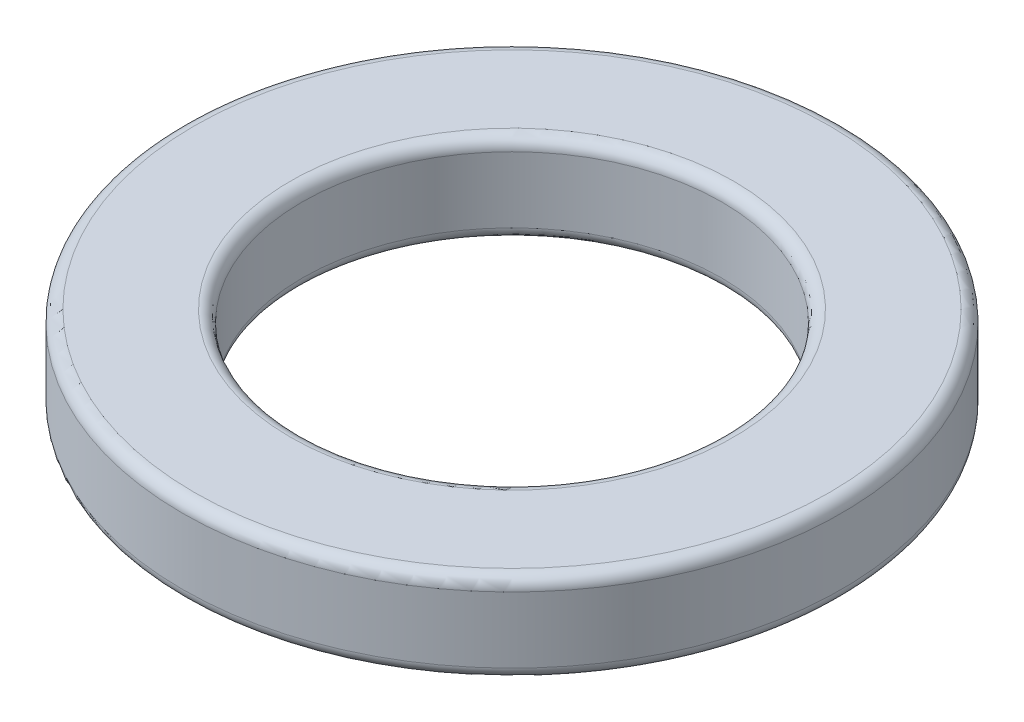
from build123d import *

# Parameters (mm, degrees)
ESQUISSE1_W = 4
ESQUISSE1_H = 3
CONG_1_R    = 0.4


with BuildPart() as part:
    # Esquisse1 → Base-R_volution (revolve)
    with BuildSketch(Plane.XY, mode=Mode.PRIVATE) as base_r_volution_sk:
        with Locations((9, 1.5)):
            Rectangle(ESQUISSE1_W, ESQUISSE1_H)
    revolve(base_r_volution_sk.sketch.rotate(Axis((0, 15.788926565, 0), (0, -1, 0)), 90), axis=Axis((0, 15.788926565, 0), (0, -1, 0)))

    # Cong_1
    cong_1_edges = [part.edges().sort_by_distance(p)[0] for p in [
        (0, 0, -7),
        (0, 0, -11),
        (0, 3, -11),
        (0, 3, -7),
    ]]
    fillet(cong_1_edges, radius=CONG_1_R)


solid = part.part
